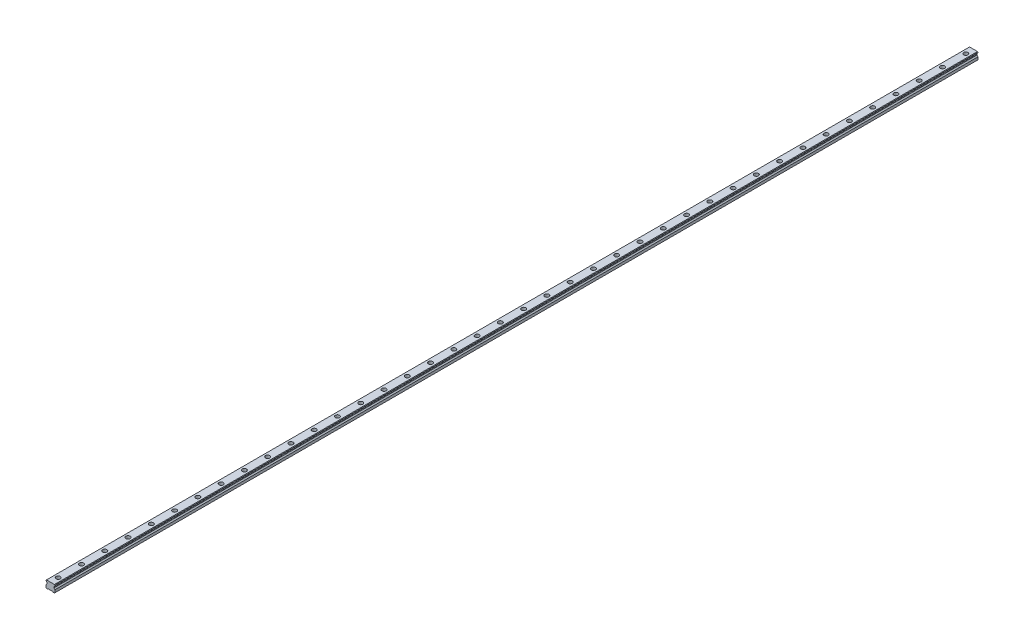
from build123d import *

# Parameters (mm, degrees)
SKETCH1_W           = 23
SKETCH1_H           = 19.2
BOSS_EXTRUDE1_DEPTH = 1190
CUT_EXTRUDE1_DEPTH  = 2381.105226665
CHAMFER1_SIZE       = 1.25
FILLET1_R           = 1.25
CUT_EXTRUDE2_DEPTH  = 2381.105226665
SKETCH4_R           = 5.5
SKETCH4_R_2         = 3.5
CUT_EXTRUDE3_DEPTH  = 9
SKETCH4_2_R         = 3.5
CUT_EXTRUDE4_DEPTH  = 1191.210439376
LPATTERN1_COUNT     = 40
LPATTERN1_PITCH     = 60


with BuildPart() as part:
    # Sketch1 → Boss-Extrude1 (new, symmetric)
    with BuildSketch(Plane.XY):
        with Locations((0, 9.6)):
            Rectangle(SKETCH1_W, SKETCH1_H)
    extrude(amount=BOSS_EXTRUDE1_DEPTH, both=True)

    # Sketch2 → Cut-Extrude1 (cut, through all)
    with BuildSketch(Plane.XY.offset(1190)):
        Polygon((-11.5, 16.7), (-11.5, 7.95), (-8.583333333, 10.866666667), (-8.583333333, 13.783333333), align=None)
        Polygon((8.583333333, 13.783333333), (11.5, 16.7), (11.5, 7.95), (8.583333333, 10.866666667), align=None)
    extrude(amount=-CUT_EXTRUDE1_DEPTH, mode=Mode.SUBTRACT)

    # Chamfer1
    chamfer1_edges = [part.edges().sort_by_distance(p)[0] for p in [
        (-11.5, 19.2, 0),
        (11.5, 19.2, 0),
        (11.5, 0, 0),
        (-11.5, 0, 0),
    ]]
    chamfer(chamfer1_edges, length=CHAMFER1_SIZE)

    # Fillet1
    fillet1_edges = [part.edges().sort_by_distance(p)[0] for p in [
        (-8.583333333, 13.783333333, 0),
        (-8.583333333, 10.866666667, 0),
        (8.583333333, 10.866666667, 0),
        (8.583333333, 13.783333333, 0),
    ]]
    fillet(fillet1_edges, radius=FILLET1_R)

    # Sketch3 → Cut-Extrude2 (cut, through all)
    with BuildSketch(Plane.XY.offset(1190)):
        Polygon((-7, 0), (-5.75, 1.25), (5.75, 1.25), (7, 0), align=None)
    extrude(amount=-CUT_EXTRUDE2_DEPTH, mode=Mode.SUBTRACT)

    # Sketch4 → Cut-Extrude3 (cut)
    with BuildSketch(Plane(origin=(0, 19.2, 0), x_dir=(1, 0, 0), z_dir=(0, 1, 0))):
        with Locations(Location((0, -1170, 0), (0, 0, 270))):
            Circle(SKETCH4_R)
        with Locations(Location((0, -1170, 0), (0, 0, 270))):
            Circle(SKETCH4_R_2, mode=Mode.SUBTRACT)
    cut_extrude3 = extrude(amount=-CUT_EXTRUDE3_DEPTH, mode=Mode.SUBTRACT)

    # Sketch4_2 → Cut-Extrude4 (cut, through all)
    with BuildSketch(Plane(origin=(0, 19.2, 0), x_dir=(1, 0, 0), z_dir=(0, 1, 0))):
        with Locations(Location((0, -1170, 0), (0, 0, 270))):
            Circle(SKETCH4_2_R)
    cut_extrude4 = extrude(amount=-CUT_EXTRUDE4_DEPTH, mode=Mode.SUBTRACT)

    # LPattern1: Cut-Extrude3, Cut-Extrude4 ×40
    with Locations(*[(0, 0, -i * LPATTERN1_PITCH) for i in range(1, LPATTERN1_COUNT)]):
        add(cut_extrude3, mode=Mode.SUBTRACT)
        add(cut_extrude4, mode=Mode.SUBTRACT)


solid = part.part
